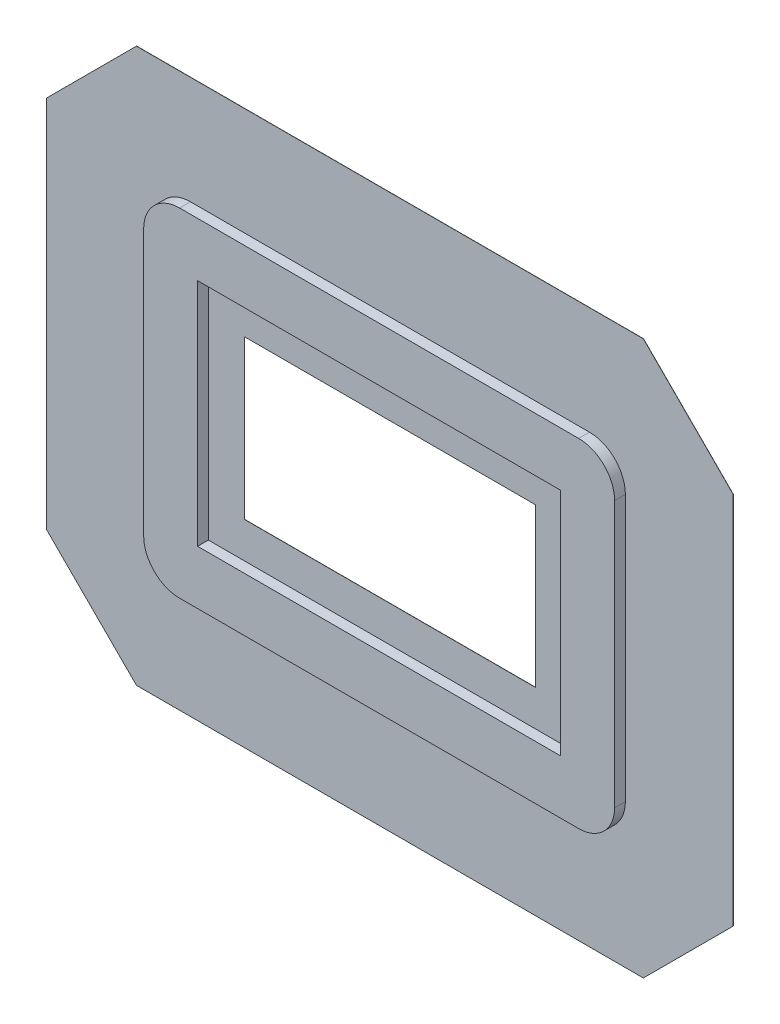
ISO-10303-21;
HEADER;
FILE_DESCRIPTION(('STEP AP214'),'2;1');
FILE_NAME('part.step','',(''),(''),'','','');
FILE_SCHEMA(('AUTOMOTIVE_DESIGN { 1 0 10303 214 1 1 1 1 }'));
ENDSEC;
DATA;
#1=APPLICATION_CONTEXT('core data for automotive mechanical design processes');
#2=APPLICATION_PROTOCOL_DEFINITION('international standard','automotive_design',2000,#1);
#3=PRODUCT_CONTEXT('',#1,'mechanical');
#4=PRODUCT('Part','Part','',(#3));
#5=PRODUCT_RELATED_PRODUCT_CATEGORY('part','',(#4));
#6=PRODUCT_DEFINITION_FORMATION('','',#4);
#7=PRODUCT_DEFINITION_CONTEXT('part definition',#1,'design');
#8=PRODUCT_DEFINITION('design','',#6,#7);
#9=PRODUCT_DEFINITION_SHAPE('','',#8);
#10=(LENGTH_UNIT() NAMED_UNIT(*) SI_UNIT(.MILLI.,.METRE.));
#11=(NAMED_UNIT(*) PLANE_ANGLE_UNIT() SI_UNIT($,.RADIAN.));
#12=(NAMED_UNIT(*) SI_UNIT($,.STERADIAN.) SOLID_ANGLE_UNIT());
#13=UNCERTAINTY_MEASURE_WITH_UNIT(LENGTH_MEASURE(1.E-05),#10,'distance_accuracy_value','');
#14=(GEOMETRIC_REPRESENTATION_CONTEXT(3) GLOBAL_UNCERTAINTY_ASSIGNED_CONTEXT((#13)) GLOBAL_UNIT_ASSIGNED_CONTEXT((#10,
#11,#12)) REPRESENTATION_CONTEXT('',''));
#15=CARTESIAN_POINT('',(0.,0.,0.));
#16=DIRECTION('',(0.,0.,1.));
#17=DIRECTION('',(1.,0.,0.));
#18=AXIS2_PLACEMENT_3D('',#15,#16,#17);
#19=CARTESIAN_POINT('',(-111.,74.,6.));
#20=DIRECTION('',(0.,0.,1.));
#21=DIRECTION('',(1.,0.,0.));
#22=AXIS2_PLACEMENT_3D('',#19,#20,#21);
#23=PLANE('',#22);
#24=CARTESIAN_POINT('',(-111.,74.,6.));
#25=DIRECTION('',(0.,0.,1.));
#26=DIRECTION('',(1.,0.,0.));
#27=AXIS2_PLACEMENT_3D('',#24,#25,#26);
#28=CIRCLE('',#27,20.);
#29=CARTESIAN_POINT('',(-111.,94.,6.));
#30=VERTEX_POINT('',#29);
#31=CARTESIAN_POINT('',(-131.,73.9999999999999,6.));
#32=VERTEX_POINT('',#31);
#33=EDGE_CURVE('E717',#30,#32,#28,.T.);
#34=ORIENTED_EDGE('',*,*,#33,.T.);
#35=DIRECTION('',(0.,-1.,0.));
#36=VECTOR('',#35,1.);
#37=CARTESIAN_POINT('',(-131.,73.9999999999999,6.));
#38=LINE('',#37,#36);
#39=CARTESIAN_POINT('',(-131.,-73.9999999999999,6.));
#40=VERTEX_POINT('',#39);
#41=EDGE_CURVE('E720',#32,#40,#38,.T.);
#42=ORIENTED_EDGE('',*,*,#41,.T.);
#43=CARTESIAN_POINT('',(-111.,-74.,6.));
#44=DIRECTION('',(0.,0.,1.));
#45=DIRECTION('',(1.,0.,0.));
#46=AXIS2_PLACEMENT_3D('',#43,#44,#45);
#47=CIRCLE('',#46,20.);
#48=CARTESIAN_POINT('',(-111.,-94.,6.));
#49=VERTEX_POINT('',#48);
#50=EDGE_CURVE('E722',#40,#49,#47,.T.);
#51=ORIENTED_EDGE('',*,*,#50,.T.);
#52=DIRECTION('',(1.,0.,0.));
#53=VECTOR('',#52,1.);
#54=CARTESIAN_POINT('',(-111.,-94.,6.));
#55=LINE('',#54,#53);
#56=CARTESIAN_POINT('',(111.,-94.,6.));
#57=VERTEX_POINT('',#56);
#58=EDGE_CURVE('E724',#49,#57,#55,.T.);
#59=ORIENTED_EDGE('',*,*,#58,.T.);
#60=CARTESIAN_POINT('',(111.,-74.,6.));
#61=DIRECTION('',(0.,0.,1.));
#62=DIRECTION('',(1.,0.,0.));
#63=AXIS2_PLACEMENT_3D('',#60,#61,#62);
#64=CIRCLE('',#63,20.);
#65=CARTESIAN_POINT('',(131.,-73.9999999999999,6.));
#66=VERTEX_POINT('',#65);
#67=EDGE_CURVE('E726',#57,#66,#64,.T.);
#68=ORIENTED_EDGE('',*,*,#67,.T.);
#69=DIRECTION('',(0.,1.,0.));
#70=VECTOR('',#69,1.);
#71=CARTESIAN_POINT('',(131.,73.9999999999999,6.));
#72=LINE('',#71,#70);
#73=CARTESIAN_POINT('',(131.,73.9999999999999,6.));
#74=VERTEX_POINT('',#73);
#75=EDGE_CURVE('E728',#66,#74,#72,.T.);
#76=ORIENTED_EDGE('',*,*,#75,.T.);
#77=CARTESIAN_POINT('',(111.,74.,6.));
#78=DIRECTION('',(0.,0.,1.));
#79=DIRECTION('',(-1.,0.,0.));
#80=AXIS2_PLACEMENT_3D('',#77,#78,#79);
#81=CIRCLE('',#80,20.);
#82=CARTESIAN_POINT('',(111.,94.,6.));
#83=VERTEX_POINT('',#82);
#84=EDGE_CURVE('E730',#74,#83,#81,.T.);
#85=ORIENTED_EDGE('',*,*,#84,.T.);
#86=DIRECTION('',(-1.,0.,0.));
#87=VECTOR('',#86,1.);
#88=CARTESIAN_POINT('',(-111.,94.,6.));
#89=LINE('',#88,#87);
#90=EDGE_CURVE('E732',#83,#30,#89,.T.);
#91=ORIENTED_EDGE('',*,*,#90,.T.);
#92=EDGE_LOOP('',(#34,#42,#51,#59,#68,#76,#85,#91));
#93=FACE_BOUND('',#92,.T.);
#94=DIRECTION('',(1.,0.,0.));
#95=VECTOR('',#94,1.);
#96=CARTESIAN_POINT('',(-111.,-64.,6.));
#97=LINE('',#96,#95);
#98=CARTESIAN_POINT('',(-101.,-64.,6.));
#99=VERTEX_POINT('',#98);
#100=CARTESIAN_POINT('',(101.,-64.,6.));
#101=VERTEX_POINT('',#100);
#102=EDGE_CURVE('E677',#99,#101,#97,.T.);
#103=ORIENTED_EDGE('',*,*,#102,.F.);
#104=DIRECTION('',(0.,-1.,0.));
#105=VECTOR('',#104,1.);
#106=CARTESIAN_POINT('',(-101.,73.9999999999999,6.));
#107=LINE('',#106,#105);
#108=CARTESIAN_POINT('',(-101.,64.,6.));
#109=VERTEX_POINT('',#108);
#110=EDGE_CURVE('E675',#109,#99,#107,.T.);
#111=ORIENTED_EDGE('',*,*,#110,.F.);
#112=DIRECTION('',(-1.,0.,0.));
#113=VECTOR('',#112,1.);
#114=CARTESIAN_POINT('',(-111.,64.,6.));
#115=LINE('',#114,#113);
#116=CARTESIAN_POINT('',(101.,64.,6.));
#117=VERTEX_POINT('',#116);
#118=EDGE_CURVE('E682',#117,#109,#115,.T.);
#119=ORIENTED_EDGE('',*,*,#118,.F.);
#120=DIRECTION('',(0.,1.,0.));
#121=VECTOR('',#120,1.);
#122=CARTESIAN_POINT('',(101.,73.9999999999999,6.));
#123=LINE('',#122,#121);
#124=EDGE_CURVE('E679',#101,#117,#123,.T.);
#125=ORIENTED_EDGE('',*,*,#124,.F.);
#126=EDGE_LOOP('',(#103,#111,#119,#125));
#127=FACE_BOUND('',#126,.T.);
#128=ADVANCED_FACE('F438',(#93,#127),#23,.T.);
#129=CARTESIAN_POINT('',(-111.,74.,6.));
#130=DIRECTION('',(0.,0.,-1.));
#131=DIRECTION('',(-1.,0.,0.));
#132=AXIS2_PLACEMENT_3D('',#129,#130,#131);
#133=CYLINDRICAL_SURFACE('',#132,20.);
#134=CARTESIAN_POINT('',(-111.,74.,0.));
#135=DIRECTION('',(0.,0.,1.));
#136=DIRECTION('',(1.,0.,0.));
#137=AXIS2_PLACEMENT_3D('',#134,#135,#136);
#138=CIRCLE('',#137,20.);
#139=CARTESIAN_POINT('',(-111.,94.,0.));
#140=VERTEX_POINT('',#139);
#141=CARTESIAN_POINT('',(-131.,73.9999999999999,0.));
#142=VERTEX_POINT('',#141);
#143=EDGE_CURVE('E693',#140,#142,#138,.T.);
#144=ORIENTED_EDGE('',*,*,#143,.T.);
#145=DIRECTION('',(0.,0.,-1.));
#146=VECTOR('',#145,1.);
#147=CARTESIAN_POINT('',(-131.,73.9999999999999,6.));
#148=LINE('',#147,#146);
#149=EDGE_CURVE('E755',#32,#142,#148,.T.);
#150=ORIENTED_EDGE('',*,*,#149,.F.);
#151=ORIENTED_EDGE('',*,*,#33,.F.);
#152=DIRECTION('',(0.,0.,-1.));
#153=VECTOR('',#152,1.);
#154=CARTESIAN_POINT('',(-111.,94.,6.));
#155=LINE('',#154,#153);
#156=EDGE_CURVE('E734',#30,#140,#155,.T.);
#157=ORIENTED_EDGE('',*,*,#156,.T.);
#158=EDGE_LOOP('',(#144,#150,#151,#157));
#159=FACE_BOUND('',#158,.T.);
#160=ADVANCED_FACE('F440',(#159),#133,.T.);
#161=CARTESIAN_POINT('',(-131.,73.9999999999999,6.));
#162=DIRECTION('',(1.,0.,0.));
#163=DIRECTION('',(0.,1.,0.));
#164=AXIS2_PLACEMENT_3D('',#161,#162,#163);
#165=PLANE('',#164);
#166=DIRECTION('',(0.,-1.,0.));
#167=VECTOR('',#166,1.);
#168=CARTESIAN_POINT('',(-131.,73.9999999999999,0.));
#169=LINE('',#168,#167);
#170=CARTESIAN_POINT('',(-131.,-74.,0.));
#171=VERTEX_POINT('',#170);
#172=EDGE_CURVE('E696',#142,#171,#169,.T.);
#173=ORIENTED_EDGE('',*,*,#172,.T.);
#174=DIRECTION('',(0.,0.,-1.));
#175=VECTOR('',#174,1.);
#176=CARTESIAN_POINT('',(-131.,-73.9999999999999,6.));
#177=LINE('',#176,#175);
#178=EDGE_CURVE('E752',#40,#171,#177,.T.);
#179=ORIENTED_EDGE('',*,*,#178,.F.);
#180=ORIENTED_EDGE('',*,*,#41,.F.);
#181=ORIENTED_EDGE('',*,*,#149,.T.);
#182=EDGE_LOOP('',(#173,#179,#180,#181));
#183=FACE_BOUND('',#182,.T.);
#184=ADVANCED_FACE('F836',(#183),#165,.F.);
#185=CARTESIAN_POINT('',(-111.,-74.,6.));
#186=DIRECTION('',(0.,0.,-1.));
#187=DIRECTION('',(-1.,0.,0.));
#188=AXIS2_PLACEMENT_3D('',#185,#186,#187);
#189=CYLINDRICAL_SURFACE('',#188,20.);
#190=CARTESIAN_POINT('',(-111.,-74.,0.));
#191=DIRECTION('',(0.,0.,1.));
#192=DIRECTION('',(1.,0.,0.));
#193=AXIS2_PLACEMENT_3D('',#190,#191,#192);
#194=CIRCLE('',#193,20.);
#195=CARTESIAN_POINT('',(-111.,-94.,0.));
#196=VERTEX_POINT('',#195);
#197=EDGE_CURVE('E699',#171,#196,#194,.T.);
#198=ORIENTED_EDGE('',*,*,#197,.T.);
#199=DIRECTION('',(0.,0.,-1.));
#200=VECTOR('',#199,1.);
#201=CARTESIAN_POINT('',(-111.,-94.,6.));
#202=LINE('',#201,#200);
#203=EDGE_CURVE('E749',#49,#196,#202,.T.);
#204=ORIENTED_EDGE('',*,*,#203,.F.);
#205=ORIENTED_EDGE('',*,*,#50,.F.);
#206=ORIENTED_EDGE('',*,*,#178,.T.);
#207=EDGE_LOOP('',(#198,#204,#205,#206));
#208=FACE_BOUND('',#207,.T.);
#209=ADVANCED_FACE('F862',(#208),#189,.T.);
#210=CARTESIAN_POINT('',(-111.,-94.,6.));
#211=DIRECTION('',(0.,1.,0.));
#212=DIRECTION('',(0.,0.,1.));
#213=AXIS2_PLACEMENT_3D('',#210,#211,#212);
#214=PLANE('',#213);
#215=DIRECTION('',(1.,0.,0.));
#216=VECTOR('',#215,1.);
#217=CARTESIAN_POINT('',(-111.,-94.,0.));
#218=LINE('',#217,#216);
#219=CARTESIAN_POINT('',(111.,-94.,0.));
#220=VERTEX_POINT('',#219);
#221=EDGE_CURVE('E702',#196,#220,#218,.T.);
#222=ORIENTED_EDGE('',*,*,#221,.T.);
#223=DIRECTION('',(0.,0.,-1.));
#224=VECTOR('',#223,1.);
#225=CARTESIAN_POINT('',(111.,-94.,6.));
#226=LINE('',#225,#224);
#227=EDGE_CURVE('E746',#57,#220,#226,.T.);
#228=ORIENTED_EDGE('',*,*,#227,.F.);
#229=ORIENTED_EDGE('',*,*,#58,.F.);
#230=ORIENTED_EDGE('',*,*,#203,.T.);
#231=EDGE_LOOP('',(#222,#228,#229,#230));
#232=FACE_BOUND('',#231,.T.);
#233=ADVANCED_FACE('F858',(#232),#214,.F.);
#234=CARTESIAN_POINT('',(111.,-74.,6.));
#235=DIRECTION('',(0.,0.,-1.));
#236=DIRECTION('',(-1.,0.,0.));
#237=AXIS2_PLACEMENT_3D('',#234,#235,#236);
#238=CYLINDRICAL_SURFACE('',#237,20.);
#239=CARTESIAN_POINT('',(111.,-74.,0.));
#240=DIRECTION('',(0.,0.,1.));
#241=DIRECTION('',(1.,0.,0.));
#242=AXIS2_PLACEMENT_3D('',#239,#240,#241);
#243=CIRCLE('',#242,20.);
#244=CARTESIAN_POINT('',(131.,-73.9999999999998,0.));
#245=VERTEX_POINT('',#244);
#246=EDGE_CURVE('E705',#220,#245,#243,.T.);
#247=ORIENTED_EDGE('',*,*,#246,.T.);
#248=DIRECTION('',(0.,0.,-1.));
#249=VECTOR('',#248,1.);
#250=CARTESIAN_POINT('',(131.,-73.9999999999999,6.));
#251=LINE('',#250,#249);
#252=EDGE_CURVE('E743',#66,#245,#251,.T.);
#253=ORIENTED_EDGE('',*,*,#252,.F.);
#254=ORIENTED_EDGE('',*,*,#67,.F.);
#255=ORIENTED_EDGE('',*,*,#227,.T.);
#256=EDGE_LOOP('',(#247,#253,#254,#255));
#257=FACE_BOUND('',#256,.T.);
#258=ADVANCED_FACE('F854',(#257),#238,.T.);
#259=CARTESIAN_POINT('',(131.,73.9999999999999,6.));
#260=DIRECTION('',(-1.,0.,0.));
#261=DIRECTION('',(0.,-1.,0.));
#262=AXIS2_PLACEMENT_3D('',#259,#260,#261);
#263=PLANE('',#262);
#264=DIRECTION('',(0.,1.,0.));
#265=VECTOR('',#264,1.);
#266=CARTESIAN_POINT('',(131.,73.9999999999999,0.));
#267=LINE('',#266,#265);
#268=CARTESIAN_POINT('',(131.,73.9999999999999,0.));
#269=VERTEX_POINT('',#268);
#270=EDGE_CURVE('E708',#245,#269,#267,.T.);
#271=ORIENTED_EDGE('',*,*,#270,.T.);
#272=DIRECTION('',(0.,0.,-1.));
#273=VECTOR('',#272,1.);
#274=CARTESIAN_POINT('',(131.,73.9999999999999,6.));
#275=LINE('',#274,#273);
#276=EDGE_CURVE('E740',#74,#269,#275,.T.);
#277=ORIENTED_EDGE('',*,*,#276,.F.);
#278=ORIENTED_EDGE('',*,*,#75,.F.);
#279=ORIENTED_EDGE('',*,*,#252,.T.);
#280=EDGE_LOOP('',(#271,#277,#278,#279));
#281=FACE_BOUND('',#280,.T.);
#282=ADVANCED_FACE('F850',(#281),#263,.F.);
#283=CARTESIAN_POINT('',(111.,74.,6.));
#284=DIRECTION('',(0.,0.,-1.));
#285=DIRECTION('',(-1.,0.,0.));
#286=AXIS2_PLACEMENT_3D('',#283,#284,#285);
#287=CYLINDRICAL_SURFACE('',#286,20.);
#288=CARTESIAN_POINT('',(111.,74.,0.));
#289=DIRECTION('',(0.,0.,1.));
#290=DIRECTION('',(-1.,0.,0.));
#291=AXIS2_PLACEMENT_3D('',#288,#289,#290);
#292=CIRCLE('',#291,20.);
#293=CARTESIAN_POINT('',(111.,94.,0.));
#294=VERTEX_POINT('',#293);
#295=EDGE_CURVE('E711',#269,#294,#292,.T.);
#296=ORIENTED_EDGE('',*,*,#295,.T.);
#297=DIRECTION('',(0.,0.,-1.));
#298=VECTOR('',#297,1.);
#299=CARTESIAN_POINT('',(111.,94.,6.));
#300=LINE('',#299,#298);
#301=EDGE_CURVE('E737',#83,#294,#300,.T.);
#302=ORIENTED_EDGE('',*,*,#301,.F.);
#303=ORIENTED_EDGE('',*,*,#84,.F.);
#304=ORIENTED_EDGE('',*,*,#276,.T.);
#305=EDGE_LOOP('',(#296,#302,#303,#304));
#306=FACE_BOUND('',#305,.T.);
#307=ADVANCED_FACE('F846',(#306),#287,.T.);
#308=CARTESIAN_POINT('',(-111.,94.,6.));
#309=DIRECTION('',(0.,-1.,0.));
#310=DIRECTION('',(0.,0.,-1.));
#311=AXIS2_PLACEMENT_3D('',#308,#309,#310);
#312=PLANE('',#311);
#313=DIRECTION('',(-1.,0.,0.));
#314=VECTOR('',#313,1.);
#315=CARTESIAN_POINT('',(-111.,94.,0.));
#316=LINE('',#315,#314);
#317=EDGE_CURVE('E714',#294,#140,#316,.T.);
#318=ORIENTED_EDGE('',*,*,#317,.T.);
#319=ORIENTED_EDGE('',*,*,#156,.F.);
#320=ORIENTED_EDGE('',*,*,#90,.F.);
#321=ORIENTED_EDGE('',*,*,#301,.T.);
#322=EDGE_LOOP('',(#318,#319,#320,#321));
#323=FACE_BOUND('',#322,.T.);
#324=ADVANCED_FACE('F843',(#323),#312,.F.);
#325=CARTESIAN_POINT('',(-101.,73.9999999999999,6.));
#326=DIRECTION('',(1.,0.,0.));
#327=DIRECTION('',(0.,1.,0.));
#328=AXIS2_PLACEMENT_3D('',#325,#326,#327);
#329=PLANE('',#328);
#330=DIRECTION('',(0.,-1.,0.));
#331=VECTOR('',#330,1.);
#332=CARTESIAN_POINT('',(-101.,73.9999999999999,0.));
#333=LINE('',#332,#331);
#334=CARTESIAN_POINT('',(-101.,64.,0.));
#335=VERTEX_POINT('',#334);
#336=CARTESIAN_POINT('',(-101.,-64.,0.));
#337=VERTEX_POINT('',#336);
#338=EDGE_CURVE('E663',#335,#337,#333,.T.);
#339=ORIENTED_EDGE('',*,*,#338,.F.);
#340=DIRECTION('',(0.,0.,-1.));
#341=VECTOR('',#340,1.);
#342=CARTESIAN_POINT('',(-101.,64.,6.));
#343=LINE('',#342,#341);
#344=EDGE_CURVE('E684',#109,#335,#343,.T.);
#345=ORIENTED_EDGE('',*,*,#344,.F.);
#346=ORIENTED_EDGE('',*,*,#110,.T.);
#347=DIRECTION('',(0.,0.,-1.));
#348=VECTOR('',#347,1.);
#349=CARTESIAN_POINT('',(-101.,-64.,6.));
#350=LINE('',#349,#348);
#351=EDGE_CURVE('E690',#99,#337,#350,.T.);
#352=ORIENTED_EDGE('',*,*,#351,.T.);
#353=EDGE_LOOP('',(#339,#345,#346,#352));
#354=FACE_BOUND('',#353,.T.);
#355=ADVANCED_FACE('F841',(#354),#329,.T.);
#356=CARTESIAN_POINT('',(-111.,-64.,6.));
#357=DIRECTION('',(0.,1.,0.));
#358=DIRECTION('',(0.,0.,1.));
#359=AXIS2_PLACEMENT_3D('',#356,#357,#358);
#360=PLANE('',#359);
#361=DIRECTION('',(1.,0.,0.));
#362=VECTOR('',#361,1.);
#363=CARTESIAN_POINT('',(-111.,-64.,0.));
#364=LINE('',#363,#362);
#365=CARTESIAN_POINT('',(101.,-64.,0.));
#366=VERTEX_POINT('',#365);
#367=EDGE_CURVE('E666',#337,#366,#364,.T.);
#368=ORIENTED_EDGE('',*,*,#367,.F.);
#369=ORIENTED_EDGE('',*,*,#351,.F.);
#370=ORIENTED_EDGE('',*,*,#102,.T.);
#371=DIRECTION('',(0.,0.,-1.));
#372=VECTOR('',#371,1.);
#373=CARTESIAN_POINT('',(101.,-64.,6.));
#374=LINE('',#373,#372);
#375=EDGE_CURVE('E688',#101,#366,#374,.T.);
#376=ORIENTED_EDGE('',*,*,#375,.T.);
#377=EDGE_LOOP('',(#368,#369,#370,#376));
#378=FACE_BOUND('',#377,.T.);
#379=ADVANCED_FACE('F913',(#378),#360,.T.);
#380=CARTESIAN_POINT('',(101.,73.9999999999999,6.));
#381=DIRECTION('',(-1.,0.,0.));
#382=DIRECTION('',(0.,-1.,0.));
#383=AXIS2_PLACEMENT_3D('',#380,#381,#382);
#384=PLANE('',#383);
#385=DIRECTION('',(0.,1.,0.));
#386=VECTOR('',#385,1.);
#387=CARTESIAN_POINT('',(101.,73.9999999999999,0.));
#388=LINE('',#387,#386);
#389=CARTESIAN_POINT('',(101.,64.,0.));
#390=VERTEX_POINT('',#389);
#391=EDGE_CURVE('E669',#366,#390,#388,.T.);
#392=ORIENTED_EDGE('',*,*,#391,.F.);
#393=ORIENTED_EDGE('',*,*,#375,.F.);
#394=ORIENTED_EDGE('',*,*,#124,.T.);
#395=DIRECTION('',(0.,0.,-1.));
#396=VECTOR('',#395,1.);
#397=CARTESIAN_POINT('',(101.,64.,6.));
#398=LINE('',#397,#396);
#399=EDGE_CURVE('E686',#117,#390,#398,.T.);
#400=ORIENTED_EDGE('',*,*,#399,.T.);
#401=EDGE_LOOP('',(#392,#393,#394,#400));
#402=FACE_BOUND('',#401,.T.);
#403=ADVANCED_FACE('F894',(#402),#384,.T.);
#404=CARTESIAN_POINT('',(-111.,64.,6.));
#405=DIRECTION('',(0.,-1.,0.));
#406=DIRECTION('',(0.,0.,-1.));
#407=AXIS2_PLACEMENT_3D('',#404,#405,#406);
#408=PLANE('',#407);
#409=DIRECTION('',(-1.,0.,0.));
#410=VECTOR('',#409,1.);
#411=CARTESIAN_POINT('',(-111.,64.,0.));
#412=LINE('',#411,#410);
#413=EDGE_CURVE('E672',#390,#335,#412,.T.);
#414=ORIENTED_EDGE('',*,*,#413,.F.);
#415=ORIENTED_EDGE('',*,*,#399,.F.);
#416=ORIENTED_EDGE('',*,*,#118,.T.);
#417=ORIENTED_EDGE('',*,*,#344,.T.);
#418=EDGE_LOOP('',(#414,#415,#416,#417));
#419=FACE_BOUND('',#418,.T.);
#420=ADVANCED_FACE('F886',(#419),#408,.T.);
#421=CARTESIAN_POINT('',(191.,-154.,0.));
#422=DIRECTION('',(0.,0.,-1.));
#423=DIRECTION('',(-1.,0.,0.));
#424=AXIS2_PLACEMENT_3D('',#421,#422,#423);
#425=PLANE('',#424);
#426=DIRECTION('',(1.,0.,0.));
#427=VECTOR('',#426,1.);
#428=CARTESIAN_POINT('',(191.,154.,0.));
#429=LINE('',#428,#427);
#430=CARTESIAN_POINT('',(-141.,154.,0.));
#431=VERTEX_POINT('',#430);
#432=CARTESIAN_POINT('',(141.,154.,0.));
#433=VERTEX_POINT('',#432);
#434=EDGE_CURVE('E650',#431,#433,#429,.T.);
#435=ORIENTED_EDGE('',*,*,#434,.F.);
#436=DIRECTION('',(0.707106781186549,0.707106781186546,0.));
#437=VECTOR('',#436,1.);
#438=CARTESIAN_POINT('',(-141.,154.,0.));
#439=LINE('',#438,#437);
#440=CARTESIAN_POINT('',(-191.,104.,0.));
#441=VERTEX_POINT('',#440);
#442=EDGE_CURVE('E769',#431,#441,#439,.F.);
#443=ORIENTED_EDGE('',*,*,#442,.T.);
#444=DIRECTION('',(0.,1.,0.));
#445=VECTOR('',#444,1.);
#446=CARTESIAN_POINT('',(-191.,154.,0.));
#447=LINE('',#446,#445);
#448=CARTESIAN_POINT('',(-191.,-104.,0.));
#449=VERTEX_POINT('',#448);
#450=EDGE_CURVE('E647',#449,#441,#447,.T.);
#451=ORIENTED_EDGE('',*,*,#450,.F.);
#452=DIRECTION('',(-0.707106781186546,0.707106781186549,0.));
#453=VECTOR('',#452,1.);
#454=CARTESIAN_POINT('',(-191.,-104.,0.));
#455=LINE('',#454,#453);
#456=CARTESIAN_POINT('',(-141.,-154.,0.));
#457=VERTEX_POINT('',#456);
#458=EDGE_CURVE('E767',#449,#457,#455,.F.);
#459=ORIENTED_EDGE('',*,*,#458,.T.);
#460=DIRECTION('',(-1.,0.,0.));
#461=VECTOR('',#460,1.);
#462=CARTESIAN_POINT('',(191.,-154.,0.));
#463=LINE('',#462,#461);
#464=CARTESIAN_POINT('',(141.,-154.,0.));
#465=VERTEX_POINT('',#464);
#466=EDGE_CURVE('E645',#465,#457,#463,.T.);
#467=ORIENTED_EDGE('',*,*,#466,.F.);
#468=DIRECTION('',(-0.707106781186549,-0.707106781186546,0.));
#469=VECTOR('',#468,1.);
#470=CARTESIAN_POINT('',(141.,-154.,0.));
#471=LINE('',#470,#469);
#472=CARTESIAN_POINT('',(191.,-104.,0.));
#473=VERTEX_POINT('',#472);
#474=EDGE_CURVE('E765',#465,#473,#471,.F.);
#475=ORIENTED_EDGE('',*,*,#474,.T.);
#476=DIRECTION('',(0.,-1.,0.));
#477=VECTOR('',#476,1.);
#478=CARTESIAN_POINT('',(191.,154.,0.));
#479=LINE('',#478,#477);
#480=CARTESIAN_POINT('',(191.,104.,0.));
#481=VERTEX_POINT('',#480);
#482=EDGE_CURVE('E620',#481,#473,#479,.T.);
#483=ORIENTED_EDGE('',*,*,#482,.F.);
#484=DIRECTION('',(0.707106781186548,-0.707106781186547,0.));
#485=VECTOR('',#484,1.);
#486=CARTESIAN_POINT('',(191.,104.,0.));
#487=LINE('',#486,#485);
#488=EDGE_CURVE('E763',#481,#433,#487,.F.);
#489=ORIENTED_EDGE('',*,*,#488,.T.);
#490=EDGE_LOOP('',(#435,#443,#451,#459,#467,#475,#483,#489));
#491=FACE_BOUND('',#490,.T.);
#492=ORIENTED_EDGE('',*,*,#172,.F.);
#493=ORIENTED_EDGE('',*,*,#143,.F.);
#494=ORIENTED_EDGE('',*,*,#317,.F.);
#495=ORIENTED_EDGE('',*,*,#295,.F.);
#496=ORIENTED_EDGE('',*,*,#270,.F.);
#497=ORIENTED_EDGE('',*,*,#246,.F.);
#498=ORIENTED_EDGE('',*,*,#221,.F.);
#499=ORIENTED_EDGE('',*,*,#197,.F.);
#500=EDGE_LOOP('',(#492,#493,#494,#495,#496,#497,#498,#499));
#501=FACE_BOUND('',#500,.T.);
#502=ADVANCED_FACE('F797',(#491,#501),#425,.F.);
#503=CARTESIAN_POINT('',(191.,-154.,-0.1));
#504=DIRECTION('',(0.,0.,-1.));
#505=DIRECTION('',(-1.,0.,0.));
#506=AXIS2_PLACEMENT_3D('',#503,#504,#505);
#507=PLANE('',#506);
#508=DIRECTION('',(0.,1.,0.));
#509=VECTOR('',#508,1.);
#510=CARTESIAN_POINT('',(-191.,154.,-0.1));
#511=LINE('',#510,#509);
#512=CARTESIAN_POINT('',(-191.,-104.,-0.1));
#513=VERTEX_POINT('',#512);
#514=CARTESIAN_POINT('',(-191.,104.,-0.1));
#515=VERTEX_POINT('',#514);
#516=EDGE_CURVE('E657',#513,#515,#511,.T.);
#517=ORIENTED_EDGE('',*,*,#516,.T.);
#518=DIRECTION('',(-0.707106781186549,-0.707106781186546,0.));
#519=VECTOR('',#518,1.);
#520=CARTESIAN_POINT('',(-128.999999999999,166.,-0.1));
#521=LINE('',#520,#519);
#522=CARTESIAN_POINT('',(-141.,154.,-0.1));
#523=VERTEX_POINT('',#522);
#524=EDGE_CURVE('E781',#515,#523,#521,.F.);
#525=ORIENTED_EDGE('',*,*,#524,.T.);
#526=DIRECTION('',(1.,0.,0.));
#527=VECTOR('',#526,1.);
#528=CARTESIAN_POINT('',(191.,154.,-0.1));
#529=LINE('',#528,#527);
#530=CARTESIAN_POINT('',(141.,154.,-0.1));
#531=VERTEX_POINT('',#530);
#532=EDGE_CURVE('E660',#523,#531,#529,.T.);
#533=ORIENTED_EDGE('',*,*,#532,.T.);
#534=DIRECTION('',(-0.707106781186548,0.707106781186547,0.));
#535=VECTOR('',#534,1.);
#536=CARTESIAN_POINT('',(320.,-24.9999999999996,-0.1));
#537=LINE('',#536,#535);
#538=CARTESIAN_POINT('',(191.,104.,-0.1));
#539=VERTEX_POINT('',#538);
#540=EDGE_CURVE('E776',#531,#539,#537,.F.);
#541=ORIENTED_EDGE('',*,*,#540,.T.);
#542=DIRECTION('',(0.,-1.,0.));
#543=VECTOR('',#542,1.);
#544=CARTESIAN_POINT('',(191.,154.,-0.1));
#545=LINE('',#544,#543);
#546=CARTESIAN_POINT('',(191.,-104.,-0.1));
#547=VERTEX_POINT('',#546);
#548=EDGE_CURVE('E653',#539,#547,#545,.T.);
#549=ORIENTED_EDGE('',*,*,#548,.T.);
#550=DIRECTION('',(0.707106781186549,0.707106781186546,0.));
#551=VECTOR('',#550,1.);
#552=CARTESIAN_POINT('',(166.,-129.,-0.1));
#553=LINE('',#552,#551);
#554=CARTESIAN_POINT('',(141.,-154.,-0.1));
#555=VERTEX_POINT('',#554);
#556=EDGE_CURVE('E460',#547,#555,#553,.F.);
#557=ORIENTED_EDGE('',*,*,#556,.T.);
#558=DIRECTION('',(-1.,0.,0.));
#559=VECTOR('',#558,1.);
#560=CARTESIAN_POINT('',(191.,-154.,-0.1));
#561=LINE('',#560,#559);
#562=CARTESIAN_POINT('',(-141.,-154.,-0.1));
#563=VERTEX_POINT('',#562);
#564=EDGE_CURVE('E655',#555,#563,#561,.T.);
#565=ORIENTED_EDGE('',*,*,#564,.T.);
#566=DIRECTION('',(0.707106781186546,-0.707106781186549,0.));
#567=VECTOR('',#566,1.);
#568=CARTESIAN_POINT('',(24.9999999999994,-320.,-0.1));
#569=LINE('',#568,#567);
#570=EDGE_CURVE('E779',#563,#513,#569,.F.);
#571=ORIENTED_EDGE('',*,*,#570,.T.);
#572=EDGE_LOOP('',(#517,#525,#533,#541,#549,#557,#565,#571));
#573=FACE_BOUND('',#572,.T.);
#574=DIRECTION('',(-1.,0.,0.));
#575=VECTOR('',#574,1.);
#576=CARTESIAN_POINT('',(81.,-44.,-0.1));
#577=LINE('',#576,#575);
#578=CARTESIAN_POINT('',(81.,-44.,-0.1));
#579=VERTEX_POINT('',#578);
#580=CARTESIAN_POINT('',(-80.9999999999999,-44.,-0.1));
#581=VERTEX_POINT('',#580);
#582=EDGE_CURVE('E631',#579,#581,#577,.T.);
#583=ORIENTED_EDGE('',*,*,#582,.F.);
#584=DIRECTION('',(0.,-1.,0.));
#585=VECTOR('',#584,1.);
#586=CARTESIAN_POINT('',(81.,44.,-0.1));
#587=LINE('',#586,#585);
#588=CARTESIAN_POINT('',(81.,44.,-0.1));
#589=VERTEX_POINT('',#588);
#590=EDGE_CURVE('E619',#589,#579,#587,.T.);
#591=ORIENTED_EDGE('',*,*,#590,.F.);
#592=DIRECTION('',(1.,0.,0.));
#593=VECTOR('',#592,1.);
#594=CARTESIAN_POINT('',(81.,44.,-0.1));
#595=LINE('',#594,#593);
#596=CARTESIAN_POINT('',(-81.,44.,-0.1));
#597=VERTEX_POINT('',#596);
#598=EDGE_CURVE('E636',#597,#589,#595,.T.);
#599=ORIENTED_EDGE('',*,*,#598,.F.);
#600=DIRECTION('',(0.,1.,0.));
#601=VECTOR('',#600,1.);
#602=CARTESIAN_POINT('',(-80.9999999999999,44.,-0.1));
#603=LINE('',#602,#601);
#604=EDGE_CURVE('E633',#581,#597,#603,.T.);
#605=ORIENTED_EDGE('',*,*,#604,.F.);
#606=EDGE_LOOP('',(#583,#591,#599,#605));
#607=FACE_BOUND('',#606,.T.);
#608=ADVANCED_FACE('F805',(#573,#607),#507,.T.);
#609=ORIENTED_EDGE('',*,*,#338,.T.);
#610=ORIENTED_EDGE('',*,*,#367,.T.);
#611=ORIENTED_EDGE('',*,*,#391,.T.);
#612=ORIENTED_EDGE('',*,*,#413,.T.);
#613=EDGE_LOOP('',(#609,#610,#611,#612));
#614=FACE_BOUND('',#613,.T.);
#615=DIRECTION('',(0.,-1.,0.));
#616=VECTOR('',#615,1.);
#617=CARTESIAN_POINT('',(81.,44.,0.));
#618=LINE('',#617,#616);
#619=CARTESIAN_POINT('',(81.,44.,0.));
#620=VERTEX_POINT('',#619);
#621=CARTESIAN_POINT('',(81.,-44.,0.));
#622=VERTEX_POINT('',#621);
#623=EDGE_CURVE('E612',#620,#622,#618,.T.);
#624=ORIENTED_EDGE('',*,*,#623,.T.);
#625=DIRECTION('',(-1.,0.,0.));
#626=VECTOR('',#625,1.);
#627=CARTESIAN_POINT('',(81.,-44.,0.));
#628=LINE('',#627,#626);
#629=CARTESIAN_POINT('',(-80.9999999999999,-44.,0.));
#630=VERTEX_POINT('',#629);
#631=EDGE_CURVE('E600',#622,#630,#628,.T.);
#632=ORIENTED_EDGE('',*,*,#631,.T.);
#633=DIRECTION('',(0.,1.,0.));
#634=VECTOR('',#633,1.);
#635=CARTESIAN_POINT('',(-80.9999999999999,44.,0.));
#636=LINE('',#635,#634);
#637=CARTESIAN_POINT('',(-80.9999999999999,44.,0.));
#638=VERTEX_POINT('',#637);
#639=EDGE_CURVE('E611',#630,#638,#636,.T.);
#640=ORIENTED_EDGE('',*,*,#639,.T.);
#641=DIRECTION('',(1.,0.,0.));
#642=VECTOR('',#641,1.);
#643=CARTESIAN_POINT('',(81.,44.,0.));
#644=LINE('',#643,#642);
#645=EDGE_CURVE('E625',#638,#620,#644,.T.);
#646=ORIENTED_EDGE('',*,*,#645,.T.);
#647=EDGE_LOOP('',(#624,#632,#640,#646));
#648=FACE_BOUND('',#647,.T.);
#649=ADVANCED_FACE('F623',(#614,#648),#425,.F.);
#650=CARTESIAN_POINT('',(191.,154.,-0.1));
#651=DIRECTION('',(-1.,0.,0.));
#652=DIRECTION('',(0.,-1.,0.));
#653=AXIS2_PLACEMENT_3D('',#650,#651,#652);
#654=PLANE('',#653);
#655=ORIENTED_EDGE('',*,*,#482,.T.);
#656=DIRECTION('',(0.,0.,-1.));
#657=VECTOR('',#656,1.);
#658=CARTESIAN_POINT('',(191.,-104.,-0.1));
#659=LINE('',#658,#657);
#660=EDGE_CURVE('E12',#473,#547,#659,.T.);
#661=ORIENTED_EDGE('',*,*,#660,.T.);
#662=ORIENTED_EDGE('',*,*,#548,.F.);
#663=DIRECTION('',(0.,0.,1.));
#664=VECTOR('',#663,1.);
#665=CARTESIAN_POINT('',(191.,104.,-0.1));
#666=LINE('',#665,#664);
#667=EDGE_CURVE('E446',#539,#481,#666,.T.);
#668=ORIENTED_EDGE('',*,*,#667,.T.);
#669=EDGE_LOOP('',(#655,#661,#662,#668));
#670=FACE_BOUND('',#669,.T.);
#671=ADVANCED_FACE('F791',(#670),#654,.F.);
#672=CARTESIAN_POINT('',(191.,-154.,-0.1));
#673=DIRECTION('',(0.,1.,0.));
#674=DIRECTION('',(0.,0.,1.));
#675=AXIS2_PLACEMENT_3D('',#672,#673,#674);
#676=PLANE('',#675);
#677=ORIENTED_EDGE('',*,*,#466,.T.);
#678=DIRECTION('',(0.,0.,-1.));
#679=VECTOR('',#678,1.);
#680=CARTESIAN_POINT('',(-141.,-154.,-0.1));
#681=LINE('',#680,#679);
#682=EDGE_CURVE('E453',#457,#563,#681,.T.);
#683=ORIENTED_EDGE('',*,*,#682,.T.);
#684=ORIENTED_EDGE('',*,*,#564,.F.);
#685=DIRECTION('',(0.,0.,1.));
#686=VECTOR('',#685,1.);
#687=CARTESIAN_POINT('',(141.,-154.,-0.1));
#688=LINE('',#687,#686);
#689=EDGE_CURVE('E783',#555,#465,#688,.T.);
#690=ORIENTED_EDGE('',*,*,#689,.T.);
#691=EDGE_LOOP('',(#677,#683,#684,#690));
#692=FACE_BOUND('',#691,.T.);
#693=ADVANCED_FACE('F803',(#692),#676,.F.);
#694=CARTESIAN_POINT('',(-191.,154.,-0.1));
#695=DIRECTION('',(1.,0.,0.));
#696=DIRECTION('',(0.,1.,0.));
#697=AXIS2_PLACEMENT_3D('',#694,#695,#696);
#698=PLANE('',#697);
#699=ORIENTED_EDGE('',*,*,#450,.T.);
#700=DIRECTION('',(0.,0.,-1.));
#701=VECTOR('',#700,1.);
#702=CARTESIAN_POINT('',(-191.,104.,-0.1));
#703=LINE('',#702,#701);
#704=EDGE_CURVE('E774',#441,#515,#703,.T.);
#705=ORIENTED_EDGE('',*,*,#704,.T.);
#706=ORIENTED_EDGE('',*,*,#516,.F.);
#707=DIRECTION('',(0.,0.,1.));
#708=VECTOR('',#707,1.);
#709=CARTESIAN_POINT('',(-191.,-104.,-0.1));
#710=LINE('',#709,#708);
#711=EDGE_CURVE('E771',#513,#449,#710,.T.);
#712=ORIENTED_EDGE('',*,*,#711,.T.);
#713=EDGE_LOOP('',(#699,#705,#706,#712));
#714=FACE_BOUND('',#713,.T.);
#715=ADVANCED_FACE('F813',(#714),#698,.F.);
#716=CARTESIAN_POINT('',(191.,154.,-0.1));
#717=DIRECTION('',(0.,-1.,0.));
#718=DIRECTION('',(0.,0.,-1.));
#719=AXIS2_PLACEMENT_3D('',#716,#717,#718);
#720=PLANE('',#719);
#721=ORIENTED_EDGE('',*,*,#532,.F.);
#722=DIRECTION('',(0.,0.,1.));
#723=VECTOR('',#722,1.);
#724=CARTESIAN_POINT('',(-141.,154.,-0.1));
#725=LINE('',#724,#723);
#726=EDGE_CURVE('E760',#523,#431,#725,.T.);
#727=ORIENTED_EDGE('',*,*,#726,.T.);
#728=ORIENTED_EDGE('',*,*,#434,.T.);
#729=DIRECTION('',(0.,0.,-1.));
#730=VECTOR('',#729,1.);
#731=CARTESIAN_POINT('',(141.,154.,-0.1));
#732=LINE('',#731,#730);
#733=EDGE_CURVE('E758',#433,#531,#732,.T.);
#734=ORIENTED_EDGE('',*,*,#733,.T.);
#735=EDGE_LOOP('',(#721,#727,#728,#734));
#736=FACE_BOUND('',#735,.T.);
#737=ADVANCED_FACE('F821',(#736),#720,.F.);
#738=CARTESIAN_POINT('',(81.,44.,-0.1));
#739=DIRECTION('',(-1.,0.,0.));
#740=DIRECTION('',(0.,-1.,0.));
#741=AXIS2_PLACEMENT_3D('',#738,#739,#740);
#742=PLANE('',#741);
#743=ORIENTED_EDGE('',*,*,#623,.F.);
#744=DIRECTION('',(0.,0.,1.));
#745=VECTOR('',#744,1.);
#746=CARTESIAN_POINT('',(81.,44.,-0.1));
#747=LINE('',#746,#745);
#748=EDGE_CURVE('E638',#589,#620,#747,.T.);
#749=ORIENTED_EDGE('',*,*,#748,.F.);
#750=ORIENTED_EDGE('',*,*,#590,.T.);
#751=DIRECTION('',(0.,0.,1.));
#752=VECTOR('',#751,1.);
#753=CARTESIAN_POINT('',(81.,-44.,-0.1));
#754=LINE('',#753,#752);
#755=EDGE_CURVE('E603',#579,#622,#754,.T.);
#756=ORIENTED_EDGE('',*,*,#755,.T.);
#757=EDGE_LOOP('',(#743,#749,#750,#756));
#758=FACE_BOUND('',#757,.T.);
#759=ADVANCED_FACE('F615',(#758),#742,.T.);
#760=CARTESIAN_POINT('',(81.,-44.,-0.1));
#761=DIRECTION('',(0.,1.,0.));
#762=DIRECTION('',(0.,0.,1.));
#763=AXIS2_PLACEMENT_3D('',#760,#761,#762);
#764=PLANE('',#763);
#765=ORIENTED_EDGE('',*,*,#631,.F.);
#766=ORIENTED_EDGE('',*,*,#755,.F.);
#767=ORIENTED_EDGE('',*,*,#582,.T.);
#768=DIRECTION('',(0.,0.,1.));
#769=VECTOR('',#768,1.);
#770=CARTESIAN_POINT('',(-80.9999999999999,-44.,-0.1));
#771=LINE('',#770,#769);
#772=EDGE_CURVE('E606',#581,#630,#771,.T.);
#773=ORIENTED_EDGE('',*,*,#772,.T.);
#774=EDGE_LOOP('',(#765,#766,#767,#773));
#775=FACE_BOUND('',#774,.T.);
#776=ADVANCED_FACE('F602',(#775),#764,.T.);
#777=CARTESIAN_POINT('',(-80.9999999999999,44.,-0.1));
#778=DIRECTION('',(1.,0.,0.));
#779=DIRECTION('',(0.,1.,0.));
#780=AXIS2_PLACEMENT_3D('',#777,#778,#779);
#781=PLANE('',#780);
#782=ORIENTED_EDGE('',*,*,#639,.F.);
#783=ORIENTED_EDGE('',*,*,#772,.F.);
#784=ORIENTED_EDGE('',*,*,#604,.T.);
#785=DIRECTION('',(0.,0.,1.));
#786=VECTOR('',#785,1.);
#787=CARTESIAN_POINT('',(-80.9999999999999,44.,-0.1));
#788=LINE('',#787,#786);
#789=EDGE_CURVE('E640',#597,#638,#788,.T.);
#790=ORIENTED_EDGE('',*,*,#789,.T.);
#791=EDGE_LOOP('',(#782,#783,#784,#790));
#792=FACE_BOUND('',#791,.T.);
#793=ADVANCED_FACE('F936',(#792),#781,.T.);
#794=CARTESIAN_POINT('',(81.,44.,-0.1));
#795=DIRECTION('',(0.,-1.,0.));
#796=DIRECTION('',(0.,0.,-1.));
#797=AXIS2_PLACEMENT_3D('',#794,#795,#796);
#798=PLANE('',#797);
#799=ORIENTED_EDGE('',*,*,#645,.F.);
#800=ORIENTED_EDGE('',*,*,#789,.F.);
#801=ORIENTED_EDGE('',*,*,#598,.T.);
#802=ORIENTED_EDGE('',*,*,#748,.T.);
#803=EDGE_LOOP('',(#799,#800,#801,#802));
#804=FACE_BOUND('',#803,.T.);
#805=ADVANCED_FACE('F941',(#804),#798,.T.);
#806=CARTESIAN_POINT('',(-141.,154.,-0.1));
#807=DIRECTION('',(0.707106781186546,-0.707106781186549,0.));
#808=DIRECTION('',(0.707106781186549,0.707106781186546,0.));
#809=AXIS2_PLACEMENT_3D('',#806,#807,#808);
#810=PLANE('',#809);
#811=ORIENTED_EDGE('',*,*,#524,.F.);
#812=ORIENTED_EDGE('',*,*,#704,.F.);
#813=ORIENTED_EDGE('',*,*,#442,.F.);
#814=ORIENTED_EDGE('',*,*,#726,.F.);
#815=EDGE_LOOP('',(#811,#812,#813,#814));
#816=FACE_BOUND('',#815,.T.);
#817=ADVANCED_FACE('F818',(#816),#810,.F.);
#818=CARTESIAN_POINT('',(-191.,-104.,-0.1));
#819=DIRECTION('',(0.707106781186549,0.707106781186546,0.));
#820=DIRECTION('',(-0.707106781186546,0.707106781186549,0.));
#821=AXIS2_PLACEMENT_3D('',#818,#819,#820);
#822=PLANE('',#821);
#823=ORIENTED_EDGE('',*,*,#570,.F.);
#824=ORIENTED_EDGE('',*,*,#682,.F.);
#825=ORIENTED_EDGE('',*,*,#458,.F.);
#826=ORIENTED_EDGE('',*,*,#711,.F.);
#827=EDGE_LOOP('',(#823,#824,#825,#826));
#828=FACE_BOUND('',#827,.T.);
#829=ADVANCED_FACE('F810',(#828),#822,.F.);
#830=CARTESIAN_POINT('',(141.,-154.,-0.1));
#831=DIRECTION('',(-0.707106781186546,0.707106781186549,0.));
#832=DIRECTION('',(-0.707106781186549,-0.707106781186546,0.));
#833=AXIS2_PLACEMENT_3D('',#830,#831,#832);
#834=PLANE('',#833);
#835=ORIENTED_EDGE('',*,*,#556,.F.);
#836=ORIENTED_EDGE('',*,*,#660,.F.);
#837=ORIENTED_EDGE('',*,*,#474,.F.);
#838=ORIENTED_EDGE('',*,*,#689,.F.);
#839=EDGE_LOOP('',(#835,#836,#837,#838));
#840=FACE_BOUND('',#839,.T.);
#841=ADVANCED_FACE('F802',(#840),#834,.F.);
#842=CARTESIAN_POINT('',(191.,104.,-0.1));
#843=DIRECTION('',(-0.707106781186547,-0.707106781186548,0.));
#844=DIRECTION('',(0.707106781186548,-0.707106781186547,0.));
#845=AXIS2_PLACEMENT_3D('',#842,#843,#844);
#846=PLANE('',#845);
#847=ORIENTED_EDGE('',*,*,#540,.F.);
#848=ORIENTED_EDGE('',*,*,#733,.F.);
#849=ORIENTED_EDGE('',*,*,#488,.F.);
#850=ORIENTED_EDGE('',*,*,#667,.F.);
#851=EDGE_LOOP('',(#847,#848,#849,#850));
#852=FACE_BOUND('',#851,.T.);
#853=ADVANCED_FACE('F823',(#852),#846,.F.);
#854=CLOSED_SHELL('',(#128,#160,#184,#209,#233,#258,#282,#307,#324,#355,#379,#403,#420,#502,
#608,#649,#671,#693,#715,#737,#759,#776,#793,#805,#817,#829,#841,#853));
#855=MANIFOLD_SOLID_BREP('B2',#854);
#856=ADVANCED_BREP_SHAPE_REPRESENTATION('',(#18,#855),#14);
#857=SHAPE_DEFINITION_REPRESENTATION(#9,#856);
ENDSEC;
END-ISO-10303-21;
